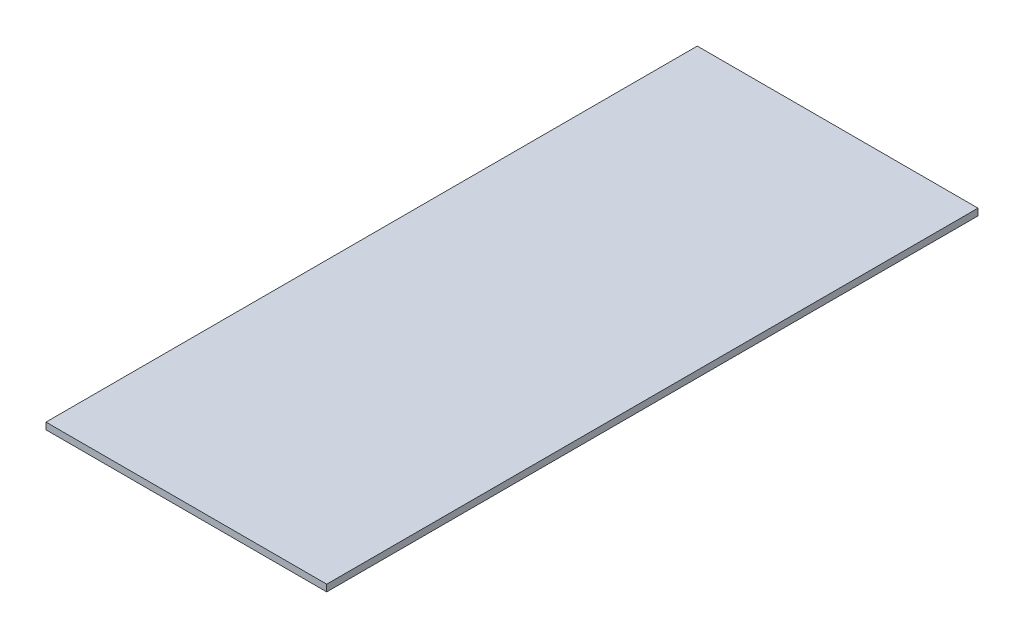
from build123d import *

# Parameters (mm, degrees)
ESBO_O1_W                = 250
ESBO_O1_H                = 475
RESSALTO_EXTRUS_O1_DEPTH = 6
ESBO_O2_W                = 250
ESBO_O2_H                = 6
RESSALTO_EXTRUS_O2_DEPTH = 25
ESBO_O3_W                = 250
ESBO_O3_H                = 6
RESSALTO_EXTRUS_O4_DEPTH = 80


with BuildPart() as part:
    # Esbo_o1 → Ressalto-extrus_o1 (new body)
    with BuildSketch(Plane(origin=(0, 0, 0), x_dir=(1, 0, 0), z_dir=(0, 1, 0))):
        with Locations((125, -237.5)):
            Rectangle(ESBO_O1_W, ESBO_O1_H)
    extrude(amount=RESSALTO_EXTRUS_O1_DEPTH)

    # Esbo_o2 → Ressalto-extrus_o2 (add)
    with BuildSketch(Plane(origin=(0, 0, 0), x_dir=(-1, 0, 0), z_dir=(0, 0, -1))):
        with Locations((-125, 3)):
            Rectangle(ESBO_O2_W, ESBO_O2_H)
    extrude(amount=RESSALTO_EXTRUS_O2_DEPTH)

    # Esbo_o3 → Ressalto-extrus_o4 (add)
    with BuildSketch(Plane(origin=(0, 0, -25), x_dir=(-1, 0, 0), z_dir=(0, 0, -1))):
        with Locations((-125, 3)):
            Rectangle(ESBO_O3_W, ESBO_O3_H)
    extrude(amount=RESSALTO_EXTRUS_O4_DEPTH)


solid = part.part
